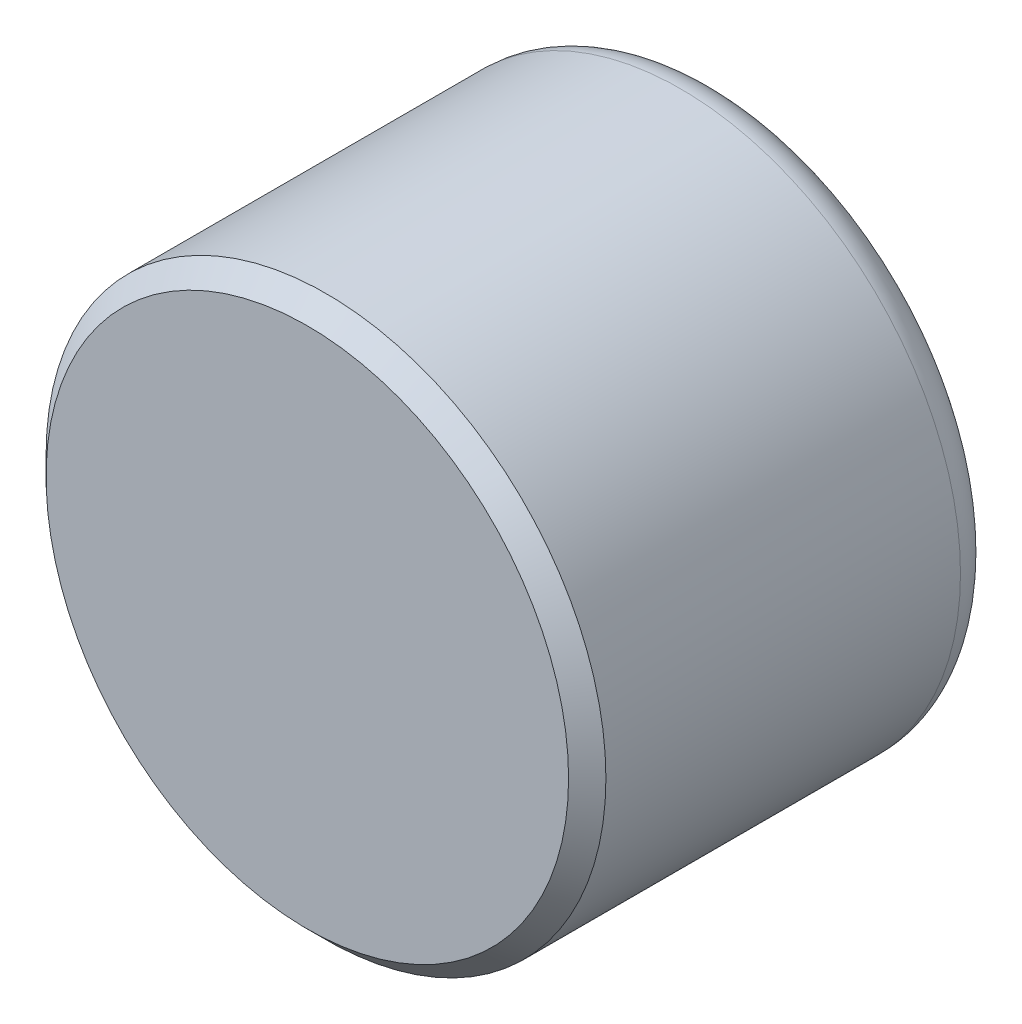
ISO-10303-21;
HEADER;
FILE_DESCRIPTION(('STEP AP214'),'2;1');
FILE_NAME('part.step','',(''),(''),'','','');
FILE_SCHEMA(('AUTOMOTIVE_DESIGN { 1 0 10303 214 1 1 1 1 }'));
ENDSEC;
DATA;
#1=APPLICATION_CONTEXT('core data for automotive mechanical design processes');
#2=APPLICATION_PROTOCOL_DEFINITION('international standard','automotive_design',2000,#1);
#3=PRODUCT_CONTEXT('',#1,'mechanical');
#4=PRODUCT('Part','Part','',(#3));
#5=PRODUCT_RELATED_PRODUCT_CATEGORY('part','',(#4));
#6=PRODUCT_DEFINITION_FORMATION('','',#4);
#7=PRODUCT_DEFINITION_CONTEXT('part definition',#1,'design');
#8=PRODUCT_DEFINITION('design','',#6,#7);
#9=PRODUCT_DEFINITION_SHAPE('','',#8);
#10=(LENGTH_UNIT() NAMED_UNIT(*) SI_UNIT(.MILLI.,.METRE.));
#11=(NAMED_UNIT(*) PLANE_ANGLE_UNIT() SI_UNIT($,.RADIAN.));
#12=(NAMED_UNIT(*) SI_UNIT($,.STERADIAN.) SOLID_ANGLE_UNIT());
#13=UNCERTAINTY_MEASURE_WITH_UNIT(LENGTH_MEASURE(1.E-05),#10,'distance_accuracy_value','');
#14=(GEOMETRIC_REPRESENTATION_CONTEXT(3) GLOBAL_UNCERTAINTY_ASSIGNED_CONTEXT((#13)) GLOBAL_UNIT_ASSIGNED_CONTEXT((#10,
#11,#12)) REPRESENTATION_CONTEXT('',''));
#15=CARTESIAN_POINT('',(0.,0.,0.));
#16=DIRECTION('',(0.,0.,1.));
#17=DIRECTION('',(1.,0.,0.));
#18=AXIS2_PLACEMENT_3D('',#15,#16,#17);
#19=CARTESIAN_POINT('',(0.,0.,22.));
#20=DIRECTION('',(0.,0.,-1.));
#21=DIRECTION('',(-1.,0.,0.));
#22=AXIS2_PLACEMENT_3D('',#19,#20,#21);
#23=CYLINDRICAL_SURFACE('',#22,15.);
#24=CARTESIAN_POINT('',(0.,0.,2.));
#25=DIRECTION('',(0.,0.,1.));
#26=DIRECTION('',(1.,0.,0.));
#27=AXIS2_PLACEMENT_3D('',#24,#25,#26);
#28=CIRCLE('',#27,15.);
#29=CARTESIAN_POINT('',(15.,0.,2.));
#30=VERTEX_POINT('',#29);
#31=EDGE_CURVE('E11',#30,#30,#28,.T.);
#32=ORIENTED_EDGE('',*,*,#31,.T.);
#33=EDGE_LOOP('',(#32));
#34=FACE_BOUND('',#33,.T.);
#35=CARTESIAN_POINT('',(0.,0.,21.));
#36=DIRECTION('',(0.,0.,1.));
#37=DIRECTION('',(1.,0.,0.));
#38=AXIS2_PLACEMENT_3D('',#35,#36,#37);
#39=CIRCLE('',#38,15.);
#40=CARTESIAN_POINT('',(15.,0.,21.));
#41=VERTEX_POINT('',#40);
#42=EDGE_CURVE('E53',#41,#41,#39,.F.);
#43=ORIENTED_EDGE('',*,*,#42,.T.);
#44=EDGE_LOOP('',(#43));
#45=FACE_BOUND('',#44,.T.);
#46=ADVANCED_FACE('F26',(#34,#45),#23,.T.);
#47=CARTESIAN_POINT('',(0.,0.,22.));
#48=DIRECTION('',(0.,0.,1.));
#49=DIRECTION('',(1.,0.,0.));
#50=AXIS2_PLACEMENT_3D('',#47,#48,#49);
#51=PLANE('',#50);
#52=CARTESIAN_POINT('',(0.,0.,22.));
#53=DIRECTION('',(0.,0.,1.));
#54=DIRECTION('',(1.,0.,0.));
#55=AXIS2_PLACEMENT_3D('',#52,#53,#54);
#56=CIRCLE('',#55,14.);
#57=CARTESIAN_POINT('',(14.,0.,22.));
#58=VERTEX_POINT('',#57);
#59=EDGE_CURVE('E48',#58,#58,#56,.T.);
#60=ORIENTED_EDGE('',*,*,#59,.T.);
#61=EDGE_LOOP('',(#60));
#62=FACE_BOUND('',#61,.T.);
#63=ADVANCED_FACE('F85',(#62),#51,.T.);
#64=CARTESIAN_POINT('',(0.,0.,0.));
#65=DIRECTION('',(0.,0.,1.));
#66=DIRECTION('',(1.,0.,0.));
#67=AXIS2_PLACEMENT_3D('',#64,#65,#66);
#68=PLANE('',#67);
#69=CARTESIAN_POINT('',(0.,0.,0.));
#70=DIRECTION('',(0.,0.,1.));
#71=DIRECTION('',(1.,0.,0.));
#72=AXIS2_PLACEMENT_3D('',#69,#70,#71);
#73=CIRCLE('',#72,12.);
#74=CARTESIAN_POINT('',(12.,0.,0.));
#75=VERTEX_POINT('',#74);
#76=EDGE_CURVE('E32',#75,#75,#73,.T.);
#77=ORIENTED_EDGE('',*,*,#76,.T.);
#78=EDGE_LOOP('',(#77));
#79=FACE_BOUND('',#78,.T.);
#80=CARTESIAN_POINT('',(0.,0.,0.));
#81=DIRECTION('',(0.,0.,1.));
#82=DIRECTION('',(1.,0.,0.));
#83=AXIS2_PLACEMENT_3D('',#80,#81,#82);
#84=CIRCLE('',#83,13.);
#85=CARTESIAN_POINT('',(13.,0.,0.));
#86=VERTEX_POINT('',#85);
#87=EDGE_CURVE('E59',#86,#86,#84,.F.);
#88=ORIENTED_EDGE('',*,*,#87,.T.);
#89=EDGE_LOOP('',(#88));
#90=FACE_BOUND('',#89,.T.);
#91=ADVANCED_FACE('F64',(#79,#90),#68,.F.);
#92=CARTESIAN_POINT('',(0.,0.,15.));
#93=DIRECTION('',(0.,0.,-1.));
#94=DIRECTION('',(-1.,0.,0.));
#95=AXIS2_PLACEMENT_3D('',#92,#93,#94);
#96=CYLINDRICAL_SURFACE('',#95,10.);
#97=CARTESIAN_POINT('',(0.,0.,2.));
#98=DIRECTION('',(0.,0.,1.));
#99=DIRECTION('',(1.,0.,0.));
#100=AXIS2_PLACEMENT_3D('',#97,#98,#99);
#101=CIRCLE('',#100,10.);
#102=CARTESIAN_POINT('',(10.,0.,2.));
#103=VERTEX_POINT('',#102);
#104=EDGE_CURVE('E56',#103,#103,#101,.F.);
#105=ORIENTED_EDGE('',*,*,#104,.T.);
#106=EDGE_LOOP('',(#105));
#107=FACE_BOUND('',#106,.T.);
#108=CARTESIAN_POINT('',(0.,0.,15.));
#109=DIRECTION('',(0.,0.,-1.));
#110=DIRECTION('',(-1.,0.,0.));
#111=AXIS2_PLACEMENT_3D('',#108,#109,#110);
#112=CIRCLE('',#111,10.);
#113=CARTESIAN_POINT('',(-10.,0.,15.));
#114=VERTEX_POINT('',#113);
#115=EDGE_CURVE('E45',#114,#114,#112,.T.);
#116=ORIENTED_EDGE('',*,*,#115,.F.);
#117=EDGE_LOOP('',(#116));
#118=FACE_BOUND('',#117,.T.);
#119=ADVANCED_FACE('F74',(#107,#118),#96,.F.);
#120=CARTESIAN_POINT('',(0.,0.,15.));
#121=DIRECTION('',(0.,0.,-1.));
#122=DIRECTION('',(-1.,0.,0.));
#123=AXIS2_PLACEMENT_3D('',#120,#121,#122);
#124=PLANE('',#123);
#125=CARTESIAN_POINT('',(0.,0.,15.));
#126=DIRECTION('',(0.,0.,-1.));
#127=DIRECTION('',(-1.,0.,0.));
#128=AXIS2_PLACEMENT_3D('',#125,#126,#127);
#129=CIRCLE('',#128,3.5);
#130=CARTESIAN_POINT('',(-3.5,0.,15.));
#131=VERTEX_POINT('',#130);
#132=EDGE_CURVE('E43',#131,#131,#129,.T.);
#133=ORIENTED_EDGE('',*,*,#132,.F.);
#134=EDGE_LOOP('',(#133));
#135=FACE_BOUND('',#134,.T.);
#136=ORIENTED_EDGE('',*,*,#115,.T.);
#137=EDGE_LOOP('',(#136));
#138=FACE_BOUND('',#137,.T.);
#139=ADVANCED_FACE('F39',(#135,#138),#124,.T.);
#140=CARTESIAN_POINT('',(0.,0.,15.));
#141=DIRECTION('',(0.,0.,-1.));
#142=DIRECTION('',(-1.,0.,0.));
#143=AXIS2_PLACEMENT_3D('',#140,#141,#142);
#144=CONICAL_SURFACE('',#143,3.5,1.0471975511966);
#145=CARTESIAN_POINT('',(0.,0.,17.0207259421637));
#146=VERTEX_POINT('',#145);
#147=VERTEX_LOOP('',#146);
#148=FACE_BOUND('',#147,.T.);
#149=ORIENTED_EDGE('',*,*,#132,.T.);
#150=EDGE_LOOP('',(#149));
#151=FACE_BOUND('',#150,.T.);
#152=ADVANCED_FACE('F35',(#148,#151),#144,.F.);
#153=CARTESIAN_POINT('',(0.,0.,22.));
#154=DIRECTION('',(0.,0.,-1.));
#155=DIRECTION('',(-1.,0.,0.));
#156=AXIS2_PLACEMENT_3D('',#153,#154,#155);
#157=CONICAL_SURFACE('',#156,14.,0.785398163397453);
#158=ORIENTED_EDGE('',*,*,#42,.F.);
#159=EDGE_LOOP('',(#158));
#160=FACE_BOUND('',#159,.T.);
#161=ORIENTED_EDGE('',*,*,#59,.F.);
#162=EDGE_LOOP('',(#161));
#163=FACE_BOUND('',#162,.T.);
#164=ADVANCED_FACE('F38',(#160,#163),#157,.T.);
#165=CARTESIAN_POINT('',(0.,0.,2.));
#166=DIRECTION('',(0.,0.,1.));
#167=DIRECTION('',(1.,0.,0.));
#168=AXIS2_PLACEMENT_3D('',#165,#166,#167);
#169=TOROIDAL_SURFACE('',#168,12.,2.);
#170=ORIENTED_EDGE('',*,*,#76,.F.);
#171=EDGE_LOOP('',(#170));
#172=FACE_BOUND('',#171,.T.);
#173=ORIENTED_EDGE('',*,*,#104,.F.);
#174=EDGE_LOOP('',(#173));
#175=FACE_BOUND('',#174,.T.);
#176=ADVANCED_FACE('F67',(#172,#175),#169,.T.);
#177=CARTESIAN_POINT('',(0.,0.,2.));
#178=DIRECTION('',(0.,0.,1.));
#179=DIRECTION('',(1.,0.,0.));
#180=AXIS2_PLACEMENT_3D('',#177,#178,#179);
#181=TOROIDAL_SURFACE('',#180,13.,2.);
#182=ORIENTED_EDGE('',*,*,#87,.F.);
#183=EDGE_LOOP('',(#182));
#184=FACE_BOUND('',#183,.T.);
#185=ORIENTED_EDGE('',*,*,#31,.F.);
#186=EDGE_LOOP('',(#185));
#187=FACE_BOUND('',#186,.T.);
#188=ADVANCED_FACE('F70',(#184,#187),#181,.T.);
#189=CLOSED_SHELL('',(#46,#63,#91,#119,#139,#152,#164,#176,#188));
#190=MANIFOLD_SOLID_BREP('B2',#189);
#191=ADVANCED_BREP_SHAPE_REPRESENTATION('',(#18,#190),#14);
#192=SHAPE_DEFINITION_REPRESENTATION(#9,#191);
ENDSEC;
END-ISO-10303-21;
